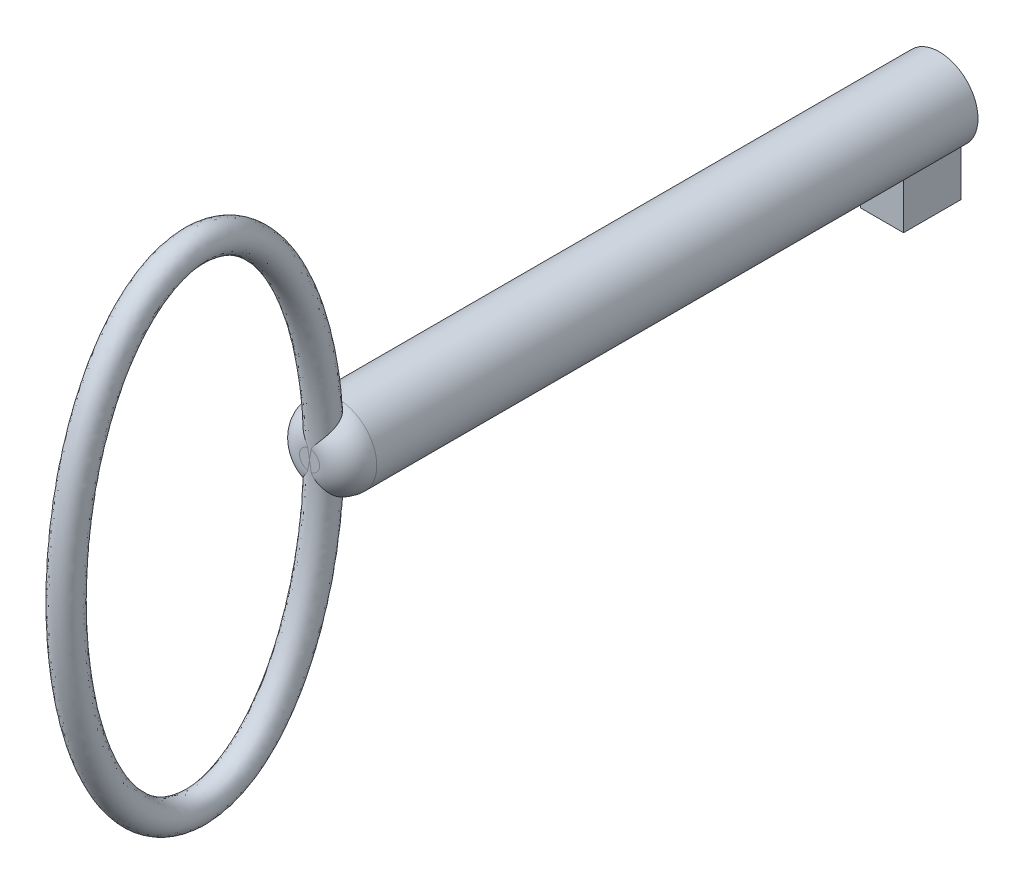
ISO-10303-21;
HEADER;
FILE_DESCRIPTION(('STEP AP214'),'2;1');
FILE_NAME('part.step','',(''),(''),'','','');
FILE_SCHEMA(('AUTOMOTIVE_DESIGN { 1 0 10303 214 1 1 1 1 }'));
ENDSEC;
DATA;
#1=APPLICATION_CONTEXT('core data for automotive mechanical design processes');
#2=APPLICATION_PROTOCOL_DEFINITION('international standard','automotive_design',2000,#1);
#3=PRODUCT_CONTEXT('',#1,'mechanical');
#4=PRODUCT('Part','Part','',(#3));
#5=PRODUCT_RELATED_PRODUCT_CATEGORY('part','',(#4));
#6=PRODUCT_DEFINITION_FORMATION('','',#4);
#7=PRODUCT_DEFINITION_CONTEXT('part definition',#1,'design');
#8=PRODUCT_DEFINITION('design','',#6,#7);
#9=PRODUCT_DEFINITION_SHAPE('','',#8);
#10=(LENGTH_UNIT() NAMED_UNIT(*) SI_UNIT(.MILLI.,.METRE.));
#11=(NAMED_UNIT(*) PLANE_ANGLE_UNIT() SI_UNIT($,.RADIAN.));
#12=(NAMED_UNIT(*) SI_UNIT($,.STERADIAN.) SOLID_ANGLE_UNIT());
#13=UNCERTAINTY_MEASURE_WITH_UNIT(LENGTH_MEASURE(1.E-05),#10,'distance_accuracy_value','');
#14=(GEOMETRIC_REPRESENTATION_CONTEXT(3) GLOBAL_UNCERTAINTY_ASSIGNED_CONTEXT((#13)) GLOBAL_UNIT_ASSIGNED_CONTEXT((#10,
#11,#12)) REPRESENTATION_CONTEXT('',''));
#15=CARTESIAN_POINT('',(0.,0.,0.));
#16=DIRECTION('',(0.,0.,1.));
#17=DIRECTION('',(1.,0.,0.));
#18=AXIS2_PLACEMENT_3D('',#15,#16,#17);
#19=CARTESIAN_POINT('',(0.,0.,34.925));
#20=DIRECTION('',(0.,0.,1.));
#21=DIRECTION('',(1.,0.,0.));
#22=AXIS2_PLACEMENT_3D('',#19,#20,#21);
#23=PLANE('',#22);
#24=CARTESIAN_POINT('',(0.0990187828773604,-0.562292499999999,34.925));
#25=CARTESIAN_POINT('',(0.0834791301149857,-0.473819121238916,34.9250000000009));
#26=CARTESIAN_POINT('',(0.0679068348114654,-0.385351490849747,34.9250000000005));
#27=CARTESIAN_POINT('',(0.0367370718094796,-0.208420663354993,34.9249999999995));
#28=CARTESIAN_POINT('',(0.021139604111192,-0.119957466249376,34.924999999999));
#29=CARTESIAN_POINT('',(0.00369962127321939,-0.0209953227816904,34.9249999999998));
#30=CARTESIAN_POINT('',(0.00184974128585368,-0.0104976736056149,34.9249999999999));
#31=CARTESIAN_POINT('',(0.,-6.10626308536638E-13,34.925));
#32=B_SPLINE_CURVE_WITH_KNOTS('',3,(#24,#25,#26,#27,#28,#29,#30,#31),.UNSPECIFIED.,.F.,.F.,(4,2,
2,4),(0.,0.269483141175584,0.538966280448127,0.570944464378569),.UNSPECIFIED.);
#33=CARTESIAN_POINT('',(0.0963683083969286,-0.547204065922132,34.925));
#34=VERTEX_POINT('',#33);
#35=CARTESIAN_POINT('',(0.,-6.10626308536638E-13,34.925));
#36=VERTEX_POINT('',#35);
#37=EDGE_CURVE('E109',#34,#36,#32,.T.);
#38=ORIENTED_EDGE('',*,*,#37,.F.);
#39=CARTESIAN_POINT('',(0.,0.,34.925));
#40=DIRECTION('',(0.,0.,1.));
#41=DIRECTION('',(1.,0.,0.));
#42=AXIS2_PLACEMENT_3D('',#39,#40,#41);
#43=CIRCLE('',#42,0.555624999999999);
#44=CARTESIAN_POINT('',(0.096368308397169,0.547204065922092,34.925));
#45=VERTEX_POINT('',#44);
#46=EDGE_CURVE('E101',#34,#45,#43,.T.);
#47=ORIENTED_EDGE('',*,*,#46,.T.);
#48=CARTESIAN_POINT('',(0.0990187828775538,0.562292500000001,34.925));
#49=CARTESIAN_POINT('',(0.083479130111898,0.473819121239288,34.9250000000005));
#50=CARTESIAN_POINT('',(0.0679068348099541,0.385351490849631,34.9250000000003));
#51=CARTESIAN_POINT('',(0.0367370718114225,0.20842066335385,34.9249999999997));
#52=CARTESIAN_POINT('',(0.0211396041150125,0.119957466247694,34.9249999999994));
#53=CARTESIAN_POINT('',(0.00369962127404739,0.0209953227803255,34.9249999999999));
#54=CARTESIAN_POINT('',(0.00184974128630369,0.0104976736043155,34.9249999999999));
#55=CARTESIAN_POINT('',(0.,-6.10626308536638E-13,34.925));
#56=B_SPLINE_CURVE_WITH_KNOTS('',3,(#48,#49,#50,#51,#52,#53,#54,#55),.UNSPECIFIED.,.F.,.F.,(4,2,
2,4),(0.,0.269483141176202,0.538966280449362,0.570944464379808),.UNSPECIFIED.);
#57=EDGE_CURVE('E113',#36,#45,#56,.F.);
#58=ORIENTED_EDGE('',*,*,#57,.F.);
#59=EDGE_LOOP('',(#38,#47,#58));
#60=FACE_BOUND('',#59,.T.);
#61=ADVANCED_FACE('F38',(#60),#23,.T.);
#62=CARTESIAN_POINT('',(-1.190625,-4.365625,3.175));
#63=DIRECTION('',(0.,1.,0.));
#64=DIRECTION('',(0.,0.,1.));
#65=AXIS2_PLACEMENT_3D('',#62,#63,#64);
#66=PLANE('',#65);
#67=DIRECTION('',(1.,0.,0.));
#68=VECTOR('',#67,1.);
#69=CARTESIAN_POINT('',(-1.190625,-4.365625,0.));
#70=LINE('',#69,#68);
#71=CARTESIAN_POINT('',(-1.190625,-4.365625,0.));
#72=VERTEX_POINT('',#71);
#73=CARTESIAN_POINT('',(1.190625,-4.365625,0.));
#74=VERTEX_POINT('',#73);
#75=EDGE_CURVE('E165',#72,#74,#70,.T.);
#76=ORIENTED_EDGE('',*,*,#75,.T.);
#77=DIRECTION('',(0.,0.,-1.));
#78=VECTOR('',#77,1.);
#79=CARTESIAN_POINT('',(1.190625,-4.365625,3.175));
#80=LINE('',#79,#78);
#81=CARTESIAN_POINT('',(1.190625,-4.365625,3.175));
#82=VERTEX_POINT('',#81);
#83=EDGE_CURVE('E171',#82,#74,#80,.T.);
#84=ORIENTED_EDGE('',*,*,#83,.F.);
#85=DIRECTION('',(1.,0.,0.));
#86=VECTOR('',#85,1.);
#87=CARTESIAN_POINT('',(-1.190625,-4.365625,3.175));
#88=LINE('',#87,#86);
#89=CARTESIAN_POINT('',(-1.190625,-4.365625,3.175));
#90=VERTEX_POINT('',#89);
#91=EDGE_CURVE('E166',#90,#82,#88,.T.);
#92=ORIENTED_EDGE('',*,*,#91,.F.);
#93=DIRECTION('',(0.,0.,-1.));
#94=VECTOR('',#93,1.);
#95=CARTESIAN_POINT('',(-1.190625,-4.365625,3.175));
#96=LINE('',#95,#94);
#97=EDGE_CURVE('E175',#90,#72,#96,.T.);
#98=ORIENTED_EDGE('',*,*,#97,.T.);
#99=EDGE_LOOP('',(#76,#84,#92,#98));
#100=FACE_BOUND('',#99,.T.);
#101=ADVANCED_FACE('F205',(#100),#66,.F.);
#102=CARTESIAN_POINT('',(1.190625,-4.365625,3.175));
#103=DIRECTION('',(-1.,0.,0.));
#104=DIRECTION('',(0.,0.,1.));
#105=AXIS2_PLACEMENT_3D('',#102,#103,#104);
#106=PLANE('',#105);
#107=DIRECTION('',(0.,1.,0.));
#108=VECTOR('',#107,1.);
#109=CARTESIAN_POINT('',(1.190625,-4.365625,0.));
#110=LINE('',#109,#108);
#111=CARTESIAN_POINT('',(1.190625,-1.78196433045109,0.));
#112=VERTEX_POINT('',#111);
#113=EDGE_CURVE('E199',#74,#112,#110,.T.);
#114=ORIENTED_EDGE('',*,*,#113,.T.);
#115=DIRECTION('',(0.,0.,-1.));
#116=VECTOR('',#115,1.);
#117=CARTESIAN_POINT('',(1.190625,-1.78196433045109,3.175));
#118=LINE('',#117,#116);
#119=CARTESIAN_POINT('',(1.190625,-1.78196433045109,3.175));
#120=VERTEX_POINT('',#119);
#121=EDGE_CURVE('E182',#120,#112,#118,.T.);
#122=ORIENTED_EDGE('',*,*,#121,.F.);
#123=DIRECTION('',(0.,1.,0.));
#124=VECTOR('',#123,1.);
#125=CARTESIAN_POINT('',(1.190625,-4.365625,3.175));
#126=LINE('',#125,#124);
#127=EDGE_CURVE('E176',#82,#120,#126,.T.);
#128=ORIENTED_EDGE('',*,*,#127,.F.);
#129=ORIENTED_EDGE('',*,*,#83,.T.);
#130=EDGE_LOOP('',(#114,#122,#128,#129));
#131=FACE_BOUND('',#130,.T.);
#132=ADVANCED_FACE('F197',(#131),#106,.F.);
#133=CARTESIAN_POINT('',(0.,0.,3.175));
#134=DIRECTION('',(0.,0.,-1.));
#135=DIRECTION('',(-1.,0.,0.));
#136=AXIS2_PLACEMENT_3D('',#133,#134,#135);
#137=CYLINDRICAL_SURFACE('',#136,2.143125);
#138=CARTESIAN_POINT('',(0.,0.,33.3375));
#139=DIRECTION('',(0.,0.,1.));
#140=DIRECTION('',(1.,0.,0.));
#141=AXIS2_PLACEMENT_3D('',#138,#139,#140);
#142=CIRCLE('',#141,2.143125);
#143=CARTESIAN_POINT('',(2.143125,0.,33.3375));
#144=VERTEX_POINT('',#143);
#145=EDGE_CURVE('E100',#144,#144,#142,.F.);
#146=ORIENTED_EDGE('',*,*,#145,.T.);
#147=EDGE_LOOP('',(#146));
#148=FACE_BOUND('',#147,.T.);
#149=CARTESIAN_POINT('',(0.,0.,0.));
#150=DIRECTION('',(0.,0.,1.));
#151=DIRECTION('',(1.,0.,0.));
#152=AXIS2_PLACEMENT_3D('',#149,#150,#151);
#153=CIRCLE('',#152,2.143125);
#154=CARTESIAN_POINT('',(-1.190625,-1.78196433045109,0.));
#155=VERTEX_POINT('',#154);
#156=EDGE_CURVE('E209',#112,#155,#153,.T.);
#157=ORIENTED_EDGE('',*,*,#156,.T.);
#158=DIRECTION('',(0.,0.,-1.));
#159=VECTOR('',#158,1.);
#160=CARTESIAN_POINT('',(-1.190625,-1.78196433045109,3.175));
#161=LINE('',#160,#159);
#162=CARTESIAN_POINT('',(-1.190625,-1.78196433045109,3.175));
#163=VERTEX_POINT('',#162);
#164=EDGE_CURVE('E179',#163,#155,#161,.T.);
#165=ORIENTED_EDGE('',*,*,#164,.F.);
#166=CARTESIAN_POINT('',(0.,0.,3.175));
#167=DIRECTION('',(0.,0.,1.));
#168=DIRECTION('',(1.,0.,0.));
#169=AXIS2_PLACEMENT_3D('',#166,#167,#168);
#170=CIRCLE('',#169,2.143125);
#171=EDGE_CURVE('E161',#163,#120,#170,.T.);
#172=ORIENTED_EDGE('',*,*,#171,.T.);
#173=ORIENTED_EDGE('',*,*,#121,.T.);
#174=EDGE_LOOP('',(#157,#165,#172,#173));
#175=FACE_BOUND('',#174,.T.);
#176=ADVANCED_FACE('F221',(#148,#175),#137,.T.);
#177=CARTESIAN_POINT('',(-1.190625,-1.78196433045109,3.175));
#178=DIRECTION('',(1.,0.,0.));
#179=DIRECTION('',(0.,0.,-1.));
#180=AXIS2_PLACEMENT_3D('',#177,#178,#179);
#181=PLANE('',#180);
#182=DIRECTION('',(0.,-1.,0.));
#183=VECTOR('',#182,1.);
#184=CARTESIAN_POINT('',(-1.190625,-1.78196433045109,0.));
#185=LINE('',#184,#183);
#186=EDGE_CURVE('E213',#155,#72,#185,.T.);
#187=ORIENTED_EDGE('',*,*,#186,.T.);
#188=ORIENTED_EDGE('',*,*,#97,.F.);
#189=DIRECTION('',(0.,-1.,0.));
#190=VECTOR('',#189,1.);
#191=CARTESIAN_POINT('',(-1.190625,-1.78196433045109,3.175));
#192=LINE('',#191,#190);
#193=EDGE_CURVE('E173',#163,#90,#192,.T.);
#194=ORIENTED_EDGE('',*,*,#193,.F.);
#195=ORIENTED_EDGE('',*,*,#164,.T.);
#196=EDGE_LOOP('',(#187,#188,#194,#195));
#197=FACE_BOUND('',#196,.T.);
#198=ADVANCED_FACE('F219',(#197),#181,.F.);
#199=CARTESIAN_POINT('',(0.,0.,3.175));
#200=DIRECTION('',(0.,0.,1.));
#201=DIRECTION('',(1.,0.,0.));
#202=AXIS2_PLACEMENT_3D('',#199,#200,#201);
#203=PLANE('',#202);
#204=ORIENTED_EDGE('',*,*,#171,.F.);
#205=ORIENTED_EDGE('',*,*,#193,.T.);
#206=ORIENTED_EDGE('',*,*,#91,.T.);
#207=ORIENTED_EDGE('',*,*,#127,.T.);
#208=EDGE_LOOP('',(#204,#205,#206,#207));
#209=FACE_BOUND('',#208,.T.);
#210=ADVANCED_FACE('F217',(#209),#203,.T.);
#211=CARTESIAN_POINT('',(0.,0.,0.));
#212=DIRECTION('',(0.,0.,1.));
#213=DIRECTION('',(1.,0.,0.));
#214=AXIS2_PLACEMENT_3D('',#211,#212,#213);
#215=PLANE('',#214);
#216=CARTESIAN_POINT('',(0.,0.,0.));
#217=DIRECTION('',(0.,0.,-1.));
#218=DIRECTION('',(-1.,0.,0.));
#219=AXIS2_PLACEMENT_3D('',#216,#217,#218);
#220=CIRCLE('',#219,0.79375);
#221=CARTESIAN_POINT('',(-0.79375,0.,0.));
#222=VERTEX_POINT('',#221);
#223=EDGE_CURVE('E245',#222,#222,#220,.T.);
#224=ORIENTED_EDGE('',*,*,#223,.F.);
#225=EDGE_LOOP('',(#224));
#226=FACE_BOUND('',#225,.T.);
#227=ORIENTED_EDGE('',*,*,#75,.F.);
#228=ORIENTED_EDGE('',*,*,#186,.F.);
#229=ORIENTED_EDGE('',*,*,#156,.F.);
#230=ORIENTED_EDGE('',*,*,#113,.F.);
#231=EDGE_LOOP('',(#227,#228,#229,#230));
#232=FACE_BOUND('',#231,.T.);
#233=ADVANCED_FACE('F227',(#226,#232),#215,.F.);
#234=CARTESIAN_POINT('',(-0.0990187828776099,0.562292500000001,34.925));
#235=CARTESIAN_POINT('',(-0.0834791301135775,0.473819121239,34.9250000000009));
#236=CARTESIAN_POINT('',(-0.0679068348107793,0.385351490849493,34.9250000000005));
#237=CARTESIAN_POINT('',(-0.0367370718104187,0.20842066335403,34.9249999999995));
#238=CARTESIAN_POINT('',(-0.021139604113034,0.119957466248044,34.924999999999));
#239=CARTESIAN_POINT('',(-0.00369962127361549,0.0209953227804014,34.9249999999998));
#240=CARTESIAN_POINT('',(-0.0018497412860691,0.0104976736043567,34.9249999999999));
#241=CARTESIAN_POINT('',(0.,-6.10626308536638E-13,34.925));
#242=B_SPLINE_CURVE_WITH_KNOTS('',3,(#234,#235,#236,#237,#238,#239,#240,#241),.UNSPECIFIED.,.F.,
.F.,(4,2,2,4),(0.,0.269483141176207,0.538966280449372,0.570944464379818),.UNSPECIFIED.);
#243=CARTESIAN_POINT('',(-0.0963683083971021,0.547204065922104,34.925));
#244=VERTEX_POINT('',#243);
#245=EDGE_CURVE('E104',#244,#36,#242,.T.);
#246=ORIENTED_EDGE('',*,*,#245,.F.);
#247=CARTESIAN_POINT('',(-0.0963683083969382,-0.547204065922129,34.925));
#248=VERTEX_POINT('',#247);
#249=EDGE_CURVE('E96',#244,#248,#43,.T.);
#250=ORIENTED_EDGE('',*,*,#249,.T.);
#251=CARTESIAN_POINT('',(-0.0990187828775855,-0.562292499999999,34.925));
#252=CARTESIAN_POINT('',(-0.083479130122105,-0.473819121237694,34.9250000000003));
#253=CARTESIAN_POINT('',(-0.0679068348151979,-0.385351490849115,34.9250000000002));
#254=CARTESIAN_POINT('',(-0.0367370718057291,-0.208420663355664,34.9249999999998));
#255=CARTESIAN_POINT('',(-0.0211396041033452,-0.119957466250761,34.9249999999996));
#256=CARTESIAN_POINT('',(-0.00369962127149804,-0.0209953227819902,34.9249999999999));
#257=CARTESIAN_POINT('',(-0.00184974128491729,-0.0104976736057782,34.9249999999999));
#258=CARTESIAN_POINT('',(0.,-6.10626308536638E-13,34.925));
#259=B_SPLINE_CURVE_WITH_KNOTS('',3,(#251,#252,#253,#254,#255,#256,#257,#258),.UNSPECIFIED.,.F.,
.F.,(4,2,2,4),(0.,0.269483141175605,0.538966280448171,0.570944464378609),.UNSPECIFIED.);
#260=EDGE_CURVE('E59',#36,#248,#259,.F.);
#261=ORIENTED_EDGE('',*,*,#260,.F.);
#262=EDGE_LOOP('',(#246,#250,#261));
#263=FACE_BOUND('',#262,.T.);
#264=ADVANCED_FACE('F105',(#263),#23,.T.);
#265=CARTESIAN_POINT('',(0.,0.,33.3375));
#266=DIRECTION('',(0.,0.,1.));
#267=DIRECTION('',(1.,0.,0.));
#268=AXIS2_PLACEMENT_3D('',#265,#266,#267);
#269=DEGENERATE_TOROIDAL_SURFACE('',#268,0.555624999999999,1.5875,.T.);
#270=CARTESIAN_POINT('',(-0.0963683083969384,-0.54720406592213,34.925));
#271=CARTESIAN_POINT('',(-0.0984879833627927,-0.559211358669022,34.9250004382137));
#272=CARTESIAN_POINT('',(-0.101694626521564,-0.570929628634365,34.9248595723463));
#273=CARTESIAN_POINT('',(-0.109625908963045,-0.593735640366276,34.9243141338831));
#274=CARTESIAN_POINT('',(-0.114337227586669,-0.604827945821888,34.9239118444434));
#275=CARTESIAN_POINT('',(-0.124638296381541,-0.626447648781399,34.9228661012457));
#276=CARTESIAN_POINT('',(-0.130220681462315,-0.636978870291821,34.9222246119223));
#277=CARTESIAN_POINT('',(-0.141977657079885,-0.657724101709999,34.9207059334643));
#278=CARTESIAN_POINT('',(-0.148153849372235,-0.667937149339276,34.9198280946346));
#279=CARTESIAN_POINT('',(-0.16826309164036,-0.699835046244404,34.9166844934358));
#280=CARTESIAN_POINT('',(-0.182865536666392,-0.721051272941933,34.9139917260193));
#281=CARTESIAN_POINT('',(-0.212775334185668,-0.762787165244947,34.907511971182));
#282=CARTESIAN_POINT('',(-0.228082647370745,-0.783306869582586,34.9037250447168));
#283=CARTESIAN_POINT('',(-0.259008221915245,-0.823878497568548,34.8950320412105));
#284=CARTESIAN_POINT('',(-0.274626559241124,-0.843930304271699,34.8901256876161));
#285=CARTESIAN_POINT('',(-0.306096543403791,-0.883902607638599,34.8791114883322));
#286=CARTESIAN_POINT('',(-0.321948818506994,-0.903818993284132,34.8729905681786));
#287=CARTESIAN_POINT('',(-0.353524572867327,-0.94334402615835,34.8595690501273));
#288=CARTESIAN_POINT('',(-0.369248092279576,-0.962952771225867,34.8522688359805));
#289=CARTESIAN_POINT('',(-0.400421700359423,-1.00190234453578,34.8364788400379));
#290=CARTESIAN_POINT('',(-0.415871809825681,-1.02124319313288,34.8279891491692));
#291=CARTESIAN_POINT('',(-0.453909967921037,-1.06918368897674,34.8053198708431));
#292=CARTESIAN_POINT('',(-0.47625220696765,-1.0976354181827,34.7904017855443));
#293=CARTESIAN_POINT('',(-0.519628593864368,-1.15400847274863,34.7579187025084));
#294=CARTESIAN_POINT('',(-0.540662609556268,-1.18192974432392,34.7403534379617));
#295=CARTESIAN_POINT('',(-0.601091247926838,-1.26472069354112,34.6838545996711));
#296=CARTESIAN_POINT('',(-0.638002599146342,-1.31884909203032,34.6410079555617));
#297=CARTESIAN_POINT('',(-0.697142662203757,-1.41661933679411,34.5530347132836));
#298=CARTESIAN_POINT('',(-0.720744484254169,-1.46061432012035,34.509219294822));
#299=CARTESIAN_POINT('',(-0.758932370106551,-1.54640281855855,34.4157905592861));
#300=CARTESIAN_POINT('',(-0.773519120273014,-1.58819650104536,34.3661776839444));
#301=CARTESIAN_POINT('',(-0.791880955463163,-1.6693052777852,34.2623612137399));
#302=CARTESIAN_POINT('',(-0.795570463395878,-1.70859839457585,34.2081247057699));
#303=CARTESIAN_POINT('',(-0.790238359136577,-1.78358163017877,34.09775272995));
#304=CARTESIAN_POINT('',(-0.781225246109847,-1.81927414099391,34.0416185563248));
#305=CARTESIAN_POINT('',(-0.751765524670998,-1.88135385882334,33.9385779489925));
#306=CARTESIAN_POINT('',(-0.73315554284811,-1.90834067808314,33.8915083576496));
#307=CARTESIAN_POINT('',(-0.685781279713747,-1.95848229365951,33.8005464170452));
#308=CARTESIAN_POINT('',(-0.657029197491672,-1.98164164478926,33.7566503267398));
#309=CARTESIAN_POINT('',(-0.594588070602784,-2.02073885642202,33.6801238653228));
#310=CARTESIAN_POINT('',(-0.562123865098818,-2.03723197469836,33.6467745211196));
#311=CARTESIAN_POINT('',(-0.49089341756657,-2.06674479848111,33.585744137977));
#312=CARTESIAN_POINT('',(-0.452130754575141,-2.07976646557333,33.5580598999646));
#313=CARTESIAN_POINT('',(-0.37311581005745,-2.10117024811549,33.5117976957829));
#314=CARTESIAN_POINT('',(-0.333285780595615,-2.10985723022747,33.4926374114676));
#315=CARTESIAN_POINT('',(-0.250545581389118,-2.12408358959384,33.4609471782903));
#316=CARTESIAN_POINT('',(-0.20763637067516,-2.1296239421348,33.4484151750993));
#317=CARTESIAN_POINT('',(-0.121994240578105,-2.13733203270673,33.4309049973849));
#318=CARTESIAN_POINT('',(-0.0793361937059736,-2.13963708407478,33.4256195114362));
#319=CARTESIAN_POINT('',(0.00633670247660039,-2.14130555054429,33.421798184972));
#320=CARTESIAN_POINT('',(0.0493515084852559,-2.14066931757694,33.423261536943));
#321=CARTESIAN_POINT('',(0.133838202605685,-2.13649223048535,33.4328067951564));
#322=CARTESIAN_POINT('',(0.175323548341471,-2.13299499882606,33.4407892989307));
#323=CARTESIAN_POINT('',(0.256254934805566,-2.12318013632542,33.4629406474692));
#324=CARTESIAN_POINT('',(0.295701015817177,-2.11686256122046,33.4771093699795));
#325=CARTESIAN_POINT('',(0.371738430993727,-2.10141311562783,33.5112121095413));
#326=CARTESIAN_POINT('',(0.408309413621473,-2.09226311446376,33.5311832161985));
#327=CARTESIAN_POINT('',(0.477379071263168,-2.07125764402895,33.576109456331));
#328=CARTESIAN_POINT('',(0.509877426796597,-2.05940196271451,33.6010649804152));
#329=CARTESIAN_POINT('',(0.570948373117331,-2.03273597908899,33.6558545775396));
#330=CARTESIAN_POINT('',(0.59937909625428,-2.01784969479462,33.6858095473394));
#331=CARTESIAN_POINT('',(0.650609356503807,-1.98554416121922,33.7489794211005));
#332=CARTESIAN_POINT('',(0.673407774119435,-1.96812440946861,33.7821949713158));
#333=CARTESIAN_POINT('',(0.71423048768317,-1.92990256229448,33.8527679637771));
#334=CARTESIAN_POINT('',(0.731903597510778,-1.90896333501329,33.8902538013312));
#335=CARTESIAN_POINT('',(0.7605830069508,-1.86479156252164,33.9663927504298));
#336=CARTESIAN_POINT('',(0.771587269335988,-1.84155831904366,34.0050462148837));
#337=CARTESIAN_POINT('',(0.787841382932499,-1.79087709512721,34.0859192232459));
#338=CARTESIAN_POINT('',(0.792474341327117,-1.76323797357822,34.1281422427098));
#339=CARTESIAN_POINT('',(0.794566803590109,-1.70594250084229,34.2113643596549));
#340=CARTESIAN_POINT('',(0.79202329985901,-1.67628530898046,34.2523629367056));
#341=CARTESIAN_POINT('',(0.779735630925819,-1.61145810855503,34.337103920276));
#342=CARTESIAN_POINT('',(0.769130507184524,-1.57606257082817,34.3805479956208));
#343=CARTESIAN_POINT('',(0.740869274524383,-1.50351751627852,34.4634819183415));
#344=CARTESIAN_POINT('',(0.723209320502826,-1.46636705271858,34.5029695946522));
#345=CARTESIAN_POINT('',(0.678856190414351,-1.38475281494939,34.5829440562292));
#346=CARTESIAN_POINT('',(0.651188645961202,-1.34004625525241,34.6226417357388));
#347=CARTESIAN_POINT('',(0.589950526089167,-1.24904266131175,34.6949308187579));
#348=CARTESIAN_POINT('',(0.556379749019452,-1.20274557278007,34.7275219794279));
#349=CARTESIAN_POINT('',(0.478879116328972,-1.10040997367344,34.7903099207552));
#350=CARTESIAN_POINT('',(0.434165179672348,-1.04408757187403,34.8190831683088));
#351=CARTESIAN_POINT('',(0.36520004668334,-0.957883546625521,34.8544558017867));
#352=CARTESIAN_POINT('',(0.34184907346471,-0.928804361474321,34.8649615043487));
#353=CARTESIAN_POINT('',(0.295023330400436,-0.869946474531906,34.8833989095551));
#354=CARTESIAN_POINT('',(0.271548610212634,-0.840168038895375,34.891331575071));
#355=CARTESIAN_POINT('',(0.227961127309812,-0.783263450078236,34.9038822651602));
#356=CARTESIAN_POINT('',(0.207784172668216,-0.756250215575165,34.908784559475));
#357=CARTESIAN_POINT('',(0.178722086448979,-0.714856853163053,34.9147027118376));
#358=CARTESIAN_POINT('',(0.169274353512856,-0.700976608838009,34.916431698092));
#359=CARTESIAN_POINT('',(0.151033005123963,-0.672741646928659,34.9194280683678));
#360=CARTESIAN_POINT('',(0.14223939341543,-0.658386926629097,34.9206954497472));
#361=CARTESIAN_POINT('',(0.125647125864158,-0.628642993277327,34.9227849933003));
#362=CARTESIAN_POINT('',(0.117873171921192,-0.613238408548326,34.9235972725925));
#363=CARTESIAN_POINT('',(0.108042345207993,-0.589242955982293,34.9244283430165));
#364=CARTESIAN_POINT('',(0.105059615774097,-0.581050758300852,34.9246408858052));
#365=CARTESIAN_POINT('',(0.0999761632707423,-0.564352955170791,34.9249273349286));
#366=CARTESIAN_POINT('',(0.0978800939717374,-0.555845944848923,34.9250005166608));
#367=CARTESIAN_POINT('',(0.0963683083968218,-0.547204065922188,34.925));
#368=B_SPLINE_CURVE_WITH_KNOTS('',3,(#270,#271,#272,#273,#274,#275,#276,#277,#278,#279,#280,
#281,#282,#283,#284,#285,#286,#287,#288,#289,#290,#291,#292,#293,#294,#295,#296,#297,#298,#299,
#300,#301,#302,#303,#304,#305,#306,#307,#308,#309,#310,#311,#312,#313,#314,#315,#316,#317,#318,
#319,#320,#321,#322,#323,#324,#325,#326,#327,#328,#329,#330,#331,#332,#333,#334,#335,#336,#337,
#338,#339,#340,#341,#342,#343,#344,#345,#346,#347,#348,#349,#350,#351,#352,#353,#354,#355,#356,
#357,#358,#359,#360,#361,#362,#363,#364,#365,#366,#367),.UNSPECIFIED.,.F.,.F.,(4,2,2,2,2,2,2,2,
2,2,2,2,2,2,2,2,2,2,2,2,2,2,2,2,2,2,2,2,2,2,2,2,2,2,2,2,2,2,2,2,2,2,2,2,2,2,2,2,4),(0.,
0.036391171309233,0.0724687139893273,0.10825627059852,0.144143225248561,0.22175641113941,
0.299365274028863,0.376993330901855,0.455507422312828,0.533996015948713,0.612478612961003,
0.729746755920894,0.847026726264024,1.08063927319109,1.27913071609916,1.47760704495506,
1.67763793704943,1.87753505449,2.04859986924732,2.21945962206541,2.36679407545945,
2.51404509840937,2.64849850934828,2.7829102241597,2.91142438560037,3.03992317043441,
3.16649842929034,3.29307118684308,3.42047151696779,3.54788183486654,3.67900215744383,
3.81014852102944,3.94885878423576,4.08761139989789,4.23902832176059,4.39050871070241,
4.56093841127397,4.73146112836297,4.92834310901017,5.12523181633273,5.35666742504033,
5.47283432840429,5.58895770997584,5.69108492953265,5.74170384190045,5.79232304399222,
5.84400264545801,5.87011952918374,5.89637183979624),.UNSPECIFIED.);
#369=EDGE_CURVE('E12',#248,#34,#368,.T.);
#370=ORIENTED_EDGE('',*,*,#369,.F.);
#371=ORIENTED_EDGE('',*,*,#249,.F.);
#372=CARTESIAN_POINT('',(0.096368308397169,0.547204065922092,34.925));
#373=CARTESIAN_POINT('',(0.0984879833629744,0.559211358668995,34.9250004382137));
#374=CARTESIAN_POINT('',(0.101694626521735,0.570929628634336,34.9248595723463));
#375=CARTESIAN_POINT('',(0.109625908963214,0.593735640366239,34.9243141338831));
#376=CARTESIAN_POINT('',(0.114337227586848,0.604827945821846,34.9239118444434));
#377=CARTESIAN_POINT('',(0.124638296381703,0.626447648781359,34.9228661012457));
#378=CARTESIAN_POINT('',(0.130220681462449,0.636978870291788,34.9222246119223));
#379=CARTESIAN_POINT('',(0.141977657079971,0.657724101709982,34.9207059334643));
#380=CARTESIAN_POINT('',(0.148153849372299,0.667937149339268,34.9198280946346));
#381=CARTESIAN_POINT('',(0.168263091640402,0.699835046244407,34.9166844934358));
#382=CARTESIAN_POINT('',(0.18286553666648,0.721051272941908,34.9139917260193));
#383=CARTESIAN_POINT('',(0.212775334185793,0.762787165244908,34.907511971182));
#384=CARTESIAN_POINT('',(0.22808264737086,0.783306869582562,34.9037250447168));
#385=CARTESIAN_POINT('',(0.259008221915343,0.823878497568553,34.8950320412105));
#386=CARTESIAN_POINT('',(0.274626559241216,0.843930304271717,34.8901256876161));
#387=CARTESIAN_POINT('',(0.306096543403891,0.883902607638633,34.8791114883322));
#388=CARTESIAN_POINT('',(0.321948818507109,0.903818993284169,34.8729905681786));
#389=CARTESIAN_POINT('',(0.353524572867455,0.943344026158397,34.8595690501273));
#390=CARTESIAN_POINT('',(0.369248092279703,0.962952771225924,34.8522688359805));
#391=CARTESIAN_POINT('',(0.400421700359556,1.00190234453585,34.8364788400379));
#392=CARTESIAN_POINT('',(0.415871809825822,1.02124319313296,34.8279891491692));
#393=CARTESIAN_POINT('',(0.453909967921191,1.06918368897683,34.805319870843));
#394=CARTESIAN_POINT('',(0.476252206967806,1.09763541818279,34.7904017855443));
#395=CARTESIAN_POINT('',(0.519628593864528,1.15400847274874,34.7579187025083));
#396=CARTESIAN_POINT('',(0.54066260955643,1.18192974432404,34.7403534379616));
#397=CARTESIAN_POINT('',(0.601091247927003,1.26472069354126,34.683854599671));
#398=CARTESIAN_POINT('',(0.638002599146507,1.31884909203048,34.6410079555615));
#399=CARTESIAN_POINT('',(0.697142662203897,1.41661933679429,34.5530347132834));
#400=CARTESIAN_POINT('',(0.720744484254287,1.46061432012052,34.5092192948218));
#401=CARTESIAN_POINT('',(0.758932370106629,1.54640281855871,34.4157905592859));
#402=CARTESIAN_POINT('',(0.773519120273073,1.5881965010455,34.3661776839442));
#403=CARTESIAN_POINT('',(0.791880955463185,1.66930527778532,34.2623612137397));
#404=CARTESIAN_POINT('',(0.795570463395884,1.70859839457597,34.2081247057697));
#405=CARTESIAN_POINT('',(0.790238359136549,1.78358163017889,34.0977527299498));
#406=CARTESIAN_POINT('',(0.7812252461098,1.81927414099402,34.0416185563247));
#407=CARTESIAN_POINT('',(0.751765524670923,1.88135385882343,33.9385779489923));
#408=CARTESIAN_POINT('',(0.733155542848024,1.90834067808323,33.8915083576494));
#409=CARTESIAN_POINT('',(0.685781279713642,1.95848229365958,33.8005464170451));
#410=CARTESIAN_POINT('',(0.657029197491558,1.98164164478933,33.7566503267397));
#411=CARTESIAN_POINT('',(0.594588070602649,2.02073885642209,33.6801238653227));
#412=CARTESIAN_POINT('',(0.56212386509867,2.03723197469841,33.6467745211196));
#413=CARTESIAN_POINT('',(0.490893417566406,2.06674479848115,33.585744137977));
#414=CARTESIAN_POINT('',(0.452130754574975,2.07976646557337,33.5580598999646));
#415=CARTESIAN_POINT('',(0.373115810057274,2.10117024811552,33.5117976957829));
#416=CARTESIAN_POINT('',(0.333285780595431,2.1098572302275,33.4926374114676));
#417=CARTESIAN_POINT('',(0.250545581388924,2.12408358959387,33.4609471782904));
#418=CARTESIAN_POINT('',(0.207636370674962,2.12962394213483,33.4484151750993));
#419=CARTESIAN_POINT('',(0.121994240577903,2.13733203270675,33.430904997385));
#420=CARTESIAN_POINT('',(0.0793361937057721,2.13963708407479,33.4256195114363));
#421=CARTESIAN_POINT('',(-0.00633670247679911,2.14130555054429,33.421798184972));
#422=CARTESIAN_POINT('',(-0.0493515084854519,2.14066931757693,33.4232615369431));
#423=CARTESIAN_POINT('',(-0.133838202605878,2.13649223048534,33.4328067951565));
#424=CARTESIAN_POINT('',(-0.175323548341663,2.13299499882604,33.4407892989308));
#425=CARTESIAN_POINT('',(-0.256254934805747,2.12318013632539,33.4629406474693));
#426=CARTESIAN_POINT('',(-0.295701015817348,2.11686256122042,33.4771093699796));
#427=CARTESIAN_POINT('',(-0.371738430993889,2.10141311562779,33.5112121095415));
#428=CARTESIAN_POINT('',(-0.408309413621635,2.09226311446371,33.5311832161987));
#429=CARTESIAN_POINT('',(-0.477379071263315,2.0712576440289,33.5761094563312));
#430=CARTESIAN_POINT('',(-0.509877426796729,2.05940196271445,33.6010649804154));
#431=CARTESIAN_POINT('',(-0.570948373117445,2.03273597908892,33.6558545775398));
#432=CARTESIAN_POINT('',(-0.59937909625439,2.01784969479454,33.6858095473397));
#433=CARTESIAN_POINT('',(-0.650609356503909,1.98554416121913,33.7489794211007));
#434=CARTESIAN_POINT('',(-0.673407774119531,1.96812440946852,33.7821949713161));
#435=CARTESIAN_POINT('',(-0.714230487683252,1.92990256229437,33.8527679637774));
#436=CARTESIAN_POINT('',(-0.731903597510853,1.90896333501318,33.8902538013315));
#437=CARTESIAN_POINT('',(-0.760583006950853,1.8647915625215,33.96639275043));
#438=CARTESIAN_POINT('',(-0.771587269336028,1.84155831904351,34.005046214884));
#439=CARTESIAN_POINT('',(-0.787841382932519,1.79087709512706,34.0859192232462));
#440=CARTESIAN_POINT('',(-0.792474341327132,1.76323797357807,34.12814224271));
#441=CARTESIAN_POINT('',(-0.794566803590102,1.70594250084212,34.2113643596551));
#442=CARTESIAN_POINT('',(-0.792023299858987,1.67628530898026,34.2523629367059));
#443=CARTESIAN_POINT('',(-0.779735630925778,1.61145810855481,34.3371039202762));
#444=CARTESIAN_POINT('',(-0.769130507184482,1.57606257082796,34.380547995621));
#445=CARTESIAN_POINT('',(-0.740869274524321,1.5035175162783,34.4634819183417));
#446=CARTESIAN_POINT('',(-0.723209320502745,1.46636705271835,34.5029695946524));
#447=CARTESIAN_POINT('',(-0.678856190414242,1.38475281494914,34.5829440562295));
#448=CARTESIAN_POINT('',(-0.651188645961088,1.34004625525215,34.622641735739));
#449=CARTESIAN_POINT('',(-0.589950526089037,1.24904266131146,34.6949308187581));
#450=CARTESIAN_POINT('',(-0.556379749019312,1.20274557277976,34.727521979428));
#451=CARTESIAN_POINT('',(-0.4788791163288,1.1004099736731,34.7903099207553));
#452=CARTESIAN_POINT('',(-0.434165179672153,1.0440875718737,34.8190831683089));
#453=CARTESIAN_POINT('',(-0.365200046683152,0.957883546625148,34.8544558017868));
#454=CARTESIAN_POINT('',(-0.341849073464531,0.928804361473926,34.8649615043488));
#455=CARTESIAN_POINT('',(-0.295023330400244,0.869946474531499,34.8833989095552));
#456=CARTESIAN_POINT('',(-0.27154861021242,0.840168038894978,34.8913315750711));
#457=CARTESIAN_POINT('',(-0.227961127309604,0.783263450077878,34.9038822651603));
#458=CARTESIAN_POINT('',(-0.207784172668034,0.75625021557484,34.9087845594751));
#459=CARTESIAN_POINT('',(-0.178722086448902,0.714856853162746,34.9147027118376));
#460=CARTESIAN_POINT('',(-0.169274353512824,0.700976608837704,34.916431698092));
#461=CARTESIAN_POINT('',(-0.151033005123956,0.6727416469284,34.9194280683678));
#462=CARTESIAN_POINT('',(-0.142239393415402,0.658386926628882,34.9206954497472));
#463=CARTESIAN_POINT('',(-0.125647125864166,0.628642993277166,34.9227849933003));
#464=CARTESIAN_POINT('',(-0.117873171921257,0.613238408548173,34.9235972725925));
#465=CARTESIAN_POINT('',(-0.10804234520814,0.589242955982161,34.9244283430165));
#466=CARTESIAN_POINT('',(-0.10505961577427,0.581050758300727,34.9246408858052));
#467=CARTESIAN_POINT('',(-0.0999761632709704,0.564352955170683,34.9249273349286));
#468=CARTESIAN_POINT('',(-0.0978800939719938,0.555845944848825,34.9250005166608));
#469=CARTESIAN_POINT('',(-0.0963683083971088,0.5472040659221,34.925));
#470=B_SPLINE_CURVE_WITH_KNOTS('',3,(#372,#373,#374,#375,#376,#377,#378,#379,#380,#381,#382,
#383,#384,#385,#386,#387,#388,#389,#390,#391,#392,#393,#394,#395,#396,#397,#398,#399,#400,#401,
#402,#403,#404,#405,#406,#407,#408,#409,#410,#411,#412,#413,#414,#415,#416,#417,#418,#419,#420,
#421,#422,#423,#424,#425,#426,#427,#428,#429,#430,#431,#432,#433,#434,#435,#436,#437,#438,#439,
#440,#441,#442,#443,#444,#445,#446,#447,#448,#449,#450,#451,#452,#453,#454,#455,#456,#457,#458,
#459,#460,#461,#462,#463,#464,#465,#466,#467,#468,#469),.UNSPECIFIED.,.F.,.F.,(4,2,2,2,2,2,2,2,
2,2,2,2,2,2,2,2,2,2,2,2,2,2,2,2,2,2,2,2,2,2,2,2,2,2,2,2,2,2,2,2,2,2,2,2,2,2,2,2,4),(0.,
0.0363911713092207,0.0724687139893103,0.108256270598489,0.144143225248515,0.221756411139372,
0.299365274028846,0.376993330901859,0.455507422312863,0.533996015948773,0.612478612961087,
0.72974675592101,0.847026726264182,1.08063927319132,1.27913071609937,1.47760704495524,
1.67763793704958,1.87753505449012,2.04859986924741,2.21945962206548,2.36679407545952,
2.51404509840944,2.64849850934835,2.78291022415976,2.91142438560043,3.03992317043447,
3.1664984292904,3.29307118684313,3.42047151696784,3.54788183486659,3.67900215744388,
3.8101485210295,3.94885878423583,4.08761139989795,4.23902832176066,4.39050871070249,
4.56093841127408,4.73146112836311,4.92834310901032,5.12523181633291,5.35666742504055,
5.47283432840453,5.5889577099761,5.69108492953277,5.74170384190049,5.79232304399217,
5.84400264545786,5.87011952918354,5.89637183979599),.UNSPECIFIED.);
#471=EDGE_CURVE('E52',#45,#244,#470,.T.);
#472=ORIENTED_EDGE('',*,*,#471,.F.);
#473=ORIENTED_EDGE('',*,*,#46,.F.);
#474=EDGE_LOOP('',(#370,#371,#472,#473));
#475=FACE_BOUND('',#474,.T.);
#476=ORIENTED_EDGE('',*,*,#145,.F.);
#477=EDGE_LOOP('',(#476));
#478=FACE_BOUND('',#477,.T.);
#479=ADVANCED_FACE('F40',(#475,#478),#269,.T.);
#480=CARTESIAN_POINT('',(0.,0.,34.925));
#481=CARTESIAN_POINT('',(0.,0.87158086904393,34.925));
#482=CARTESIAN_POINT('',(0.,2.53726944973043,35.0101814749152));
#483=CARTESIAN_POINT('',(0.,4.86854671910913,35.3706237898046));
#484=CARTESIAN_POINT('',(0.,6.87096360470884,35.897935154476));
#485=CARTESIAN_POINT('',(0.,8.515269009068,36.5294656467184));
#486=CARTESIAN_POINT('',(0.,9.81288193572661,37.2111987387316));
#487=CARTESIAN_POINT('',(0.,10.7641018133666,37.8769631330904));
#488=CARTESIAN_POINT('',(0.,11.438768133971,38.4927761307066));
#489=CARTESIAN_POINT('',(0.,11.9068942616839,39.0420365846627));
#490=CARTESIAN_POINT('',(0.,12.2416440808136,39.558426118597));
#491=CARTESIAN_POINT('',(0.,12.4687846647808,40.0387946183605));
#492=CARTESIAN_POINT('',(0.,12.6103668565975,40.4824840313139));
#493=CARTESIAN_POINT('',(0.,12.684704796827,40.8904776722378));
#494=CARTESIAN_POINT('',(0.,12.7072880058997,41.2750000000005));
#495=CARTESIAN_POINT('',(0.,12.684704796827,41.6595223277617));
#496=CARTESIAN_POINT('',(0.,12.6103668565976,42.0675159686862));
#497=CARTESIAN_POINT('',(0.,12.4687846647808,42.5112053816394));
#498=CARTESIAN_POINT('',(0.,12.2416440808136,42.991573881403));
#499=CARTESIAN_POINT('',(0.,11.9068942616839,43.5079634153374));
#500=CARTESIAN_POINT('',(0.,11.4387681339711,44.0572238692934));
#501=CARTESIAN_POINT('',(0.,10.7641018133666,44.6730368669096));
#502=CARTESIAN_POINT('',(0.,9.81288193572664,45.3388012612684));
#503=CARTESIAN_POINT('',(0.,8.51526900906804,46.0205343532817));
#504=CARTESIAN_POINT('',(0.,6.87096360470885,46.6520648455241));
#505=CARTESIAN_POINT('',(0.,4.86854671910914,47.1793762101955));
#506=CARTESIAN_POINT('',(0.,2.53726944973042,47.5398185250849));
#507=CARTESIAN_POINT('',(0.,0.,47.6695716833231));
#508=CARTESIAN_POINT('',(0.,-2.53726944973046,47.5398185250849));
#509=CARTESIAN_POINT('',(0.,-4.86854671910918,47.1793762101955));
#510=CARTESIAN_POINT('',(0.,-6.87096360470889,46.6520648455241));
#511=CARTESIAN_POINT('',(0.,-8.51526900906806,46.0205343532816));
#512=CARTESIAN_POINT('',(0.,-9.81288193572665,45.3388012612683));
#513=CARTESIAN_POINT('',(0.,-10.7641018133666,44.6730368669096));
#514=CARTESIAN_POINT('',(0.,-11.4387681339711,44.0572238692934));
#515=CARTESIAN_POINT('',(0.,-11.9068942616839,43.5079634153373));
#516=CARTESIAN_POINT('',(0.,-12.2416440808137,42.9915738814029));
#517=CARTESIAN_POINT('',(0.,-12.4687846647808,42.5112053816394));
#518=CARTESIAN_POINT('',(0.,-12.6103668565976,42.067515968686));
#519=CARTESIAN_POINT('',(0.,-12.684704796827,41.6595223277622));
#520=CARTESIAN_POINT('',(0.,-12.7072880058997,41.2749999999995));
#521=CARTESIAN_POINT('',(0.,-12.684704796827,40.8904776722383));
#522=CARTESIAN_POINT('',(0.,-12.6103668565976,40.4824840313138));
#523=CARTESIAN_POINT('',(0.,-12.4687846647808,40.0387946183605));
#524=CARTESIAN_POINT('',(0.,-12.2416440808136,39.558426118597));
#525=CARTESIAN_POINT('',(0.,-11.9068942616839,39.0420365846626));
#526=CARTESIAN_POINT('',(0.,-11.438768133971,38.4927761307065));
#527=CARTESIAN_POINT('',(0.,-10.7641018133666,37.8769631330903));
#528=CARTESIAN_POINT('',(0.,-9.81288193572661,37.2111987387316));
#529=CARTESIAN_POINT('',(0.,-8.51526900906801,36.5294656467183));
#530=CARTESIAN_POINT('',(0.,-6.87096360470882,35.8979351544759));
#531=CARTESIAN_POINT('',(0.,-4.8685467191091,35.3706237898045));
#532=CARTESIAN_POINT('',(0.,-2.5372694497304,35.0101814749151));
#533=CARTESIAN_POINT('',(0.,-0.871580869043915,34.925));
#534=CARTESIAN_POINT('',(0.,0.,34.925));
#535=CARTESIAN_POINT('',(1.5875,0.,34.925));
#536=CARTESIAN_POINT('',(1.5875,0.87158086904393,34.925));
#537=CARTESIAN_POINT('',(1.5875,2.53726944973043,35.0101814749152));
#538=CARTESIAN_POINT('',(1.5875,4.86854671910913,35.3706237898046));
#539=CARTESIAN_POINT('',(1.5875,6.87096360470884,35.897935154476));
#540=CARTESIAN_POINT('',(1.5875,8.51526900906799,36.5294656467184));
#541=CARTESIAN_POINT('',(1.5875,9.81288193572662,37.2111987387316));
#542=CARTESIAN_POINT('',(1.5875,10.7641018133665,37.8769631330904));
#543=CARTESIAN_POINT('',(1.5875,11.438768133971,38.4927761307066));
#544=CARTESIAN_POINT('',(1.5875,11.9068942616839,39.0420365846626));
#545=CARTESIAN_POINT('',(1.5875,12.2416440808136,39.558426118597));
#546=CARTESIAN_POINT('',(1.5875,12.4687846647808,40.0387946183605));
#547=CARTESIAN_POINT('',(1.5875,12.6103668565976,40.4824840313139));
#548=CARTESIAN_POINT('',(1.5875,12.684704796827,40.8904776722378));
#549=CARTESIAN_POINT('',(1.5875,12.7072880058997,41.2750000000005));
#550=CARTESIAN_POINT('',(1.5875,12.684704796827,41.6595223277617));
#551=CARTESIAN_POINT('',(1.5875,12.6103668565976,42.0675159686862));
#552=CARTESIAN_POINT('',(1.5875,12.4687846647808,42.5112053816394));
#553=CARTESIAN_POINT('',(1.5875,12.2416440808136,42.991573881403));
#554=CARTESIAN_POINT('',(1.5875,11.9068942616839,43.5079634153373));
#555=CARTESIAN_POINT('',(1.5875,11.4387681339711,44.0572238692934));
#556=CARTESIAN_POINT('',(1.5875,10.7641018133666,44.6730368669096));
#557=CARTESIAN_POINT('',(1.5875,9.81288193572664,45.3388012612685));
#558=CARTESIAN_POINT('',(1.5875,8.51526900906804,46.0205343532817));
#559=CARTESIAN_POINT('',(1.5875,6.87096360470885,46.6520648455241));
#560=CARTESIAN_POINT('',(1.5875,4.86854671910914,47.1793762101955));
#561=CARTESIAN_POINT('',(1.5875,2.53726944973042,47.5398185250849));
#562=CARTESIAN_POINT('',(1.5875,0.,47.669571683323));
#563=CARTESIAN_POINT('',(1.5875,-2.53726944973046,47.5398185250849));
#564=CARTESIAN_POINT('',(1.5875,-4.86854671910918,47.1793762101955));
#565=CARTESIAN_POINT('',(1.5875,-6.87096360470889,46.6520648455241));
#566=CARTESIAN_POINT('',(1.5875,-8.51526900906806,46.0205343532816));
#567=CARTESIAN_POINT('',(1.5875,-9.81288193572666,45.3388012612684));
#568=CARTESIAN_POINT('',(1.5875,-10.7641018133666,44.6730368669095));
#569=CARTESIAN_POINT('',(1.5875,-11.4387681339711,44.0572238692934));
#570=CARTESIAN_POINT('',(1.5875,-11.9068942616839,43.5079634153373));
#571=CARTESIAN_POINT('',(1.5875,-12.2416440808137,42.9915738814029));
#572=CARTESIAN_POINT('',(1.5875,-12.4687846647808,42.5112053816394));
#573=CARTESIAN_POINT('',(1.5875,-12.6103668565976,42.0675159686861));
#574=CARTESIAN_POINT('',(1.5875,-12.684704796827,41.6595223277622));
#575=CARTESIAN_POINT('',(1.5875,-12.7072880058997,41.2749999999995));
#576=CARTESIAN_POINT('',(1.5875,-12.684704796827,40.8904776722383));
#577=CARTESIAN_POINT('',(1.5875,-12.6103668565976,40.4824840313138));
#578=CARTESIAN_POINT('',(1.5875,-12.4687846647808,40.0387946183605));
#579=CARTESIAN_POINT('',(1.5875,-12.2416440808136,39.558426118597));
#580=CARTESIAN_POINT('',(1.5875,-11.9068942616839,39.0420365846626));
#581=CARTESIAN_POINT('',(1.5875,-11.438768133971,38.4927761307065));
#582=CARTESIAN_POINT('',(1.5875,-10.7641018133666,37.8769631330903));
#583=CARTESIAN_POINT('',(1.5875,-9.81288193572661,37.2111987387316));
#584=CARTESIAN_POINT('',(1.5875,-8.51526900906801,36.5294656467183));
#585=CARTESIAN_POINT('',(1.5875,-6.87096360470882,35.8979351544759));
#586=CARTESIAN_POINT('',(1.5875,-4.8685467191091,35.3706237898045));
#587=CARTESIAN_POINT('',(1.5875,-2.5372694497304,35.0101814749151));
#588=CARTESIAN_POINT('',(1.5875,-0.871580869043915,34.925));
#589=CARTESIAN_POINT('',(1.5875,0.,34.925));
#590=CARTESIAN_POINT('',(1.5875,0.,33.3375));
#591=CARTESIAN_POINT('',(1.5875,0.92604368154,33.3375));
#592=CARTESIAN_POINT('',(1.5875,2.69581679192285,33.4278764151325));
#593=CARTESIAN_POINT('',(1.5875,5.18662753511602,33.8124347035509));
#594=CARTESIAN_POINT('',(1.5875,7.35087725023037,34.3814592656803));
#595=CARTESIAN_POINT('',(1.5875,9.16153603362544,35.0755630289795));
#596=CARTESIAN_POINT('',(1.5875,10.6300691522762,35.8452995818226));
#597=CARTESIAN_POINT('',(1.5875,11.7477062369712,36.6251997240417));
#598=CARTESIAN_POINT('',(1.5875,12.5761300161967,37.3793502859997));
#599=CARTESIAN_POINT('',(1.5875,13.1777268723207,38.0831099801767));
#600=CARTESIAN_POINT('',(1.5875,13.6285382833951,38.7762665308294));
#601=CARTESIAN_POINT('',(1.5875,13.9478660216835,39.449332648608));
#602=CARTESIAN_POINT('',(1.5875,14.1538639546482,40.0927965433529));
#603=CARTESIAN_POINT('',(1.5875,14.2644994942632,40.6982229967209));
#604=CARTESIAN_POINT('',(1.5875,14.2984595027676,41.2749999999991));
#605=CARTESIAN_POINT('',(1.5875,14.2644994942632,41.8517770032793));
#606=CARTESIAN_POINT('',(1.5875,14.1538639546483,42.457203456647));
#607=CARTESIAN_POINT('',(1.5875,13.9478660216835,43.100667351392));
#608=CARTESIAN_POINT('',(1.5875,13.6285382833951,43.7737334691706));
#609=CARTESIAN_POINT('',(1.5875,13.1777268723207,44.4668900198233));
#610=CARTESIAN_POINT('',(1.5875,12.5761300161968,45.1706497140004));
#611=CARTESIAN_POINT('',(1.5875,11.7477062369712,45.9248002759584));
#612=CARTESIAN_POINT('',(1.5875,10.6300691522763,46.7047004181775));
#613=CARTESIAN_POINT('',(1.5875,9.16153603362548,47.4744369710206));
#614=CARTESIAN_POINT('',(1.5875,7.35087725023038,48.1685407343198));
#615=CARTESIAN_POINT('',(1.5875,5.18662753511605,48.7375652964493));
#616=CARTESIAN_POINT('',(1.5875,2.69581679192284,49.1221235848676));
#617=CARTESIAN_POINT('',(1.5875,0.,49.2597899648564));
#618=CARTESIAN_POINT('',(1.5875,-2.69581679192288,49.1221235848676));
#619=CARTESIAN_POINT('',(1.5875,-5.18662753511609,48.7375652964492));
#620=CARTESIAN_POINT('',(1.5875,-7.35087725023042,48.1685407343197));
#621=CARTESIAN_POINT('',(1.5875,-9.16153603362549,47.4744369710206));
#622=CARTESIAN_POINT('',(1.5875,-10.6300691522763,46.7047004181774));
#623=CARTESIAN_POINT('',(1.5875,-11.7477062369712,45.9248002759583));
#624=CARTESIAN_POINT('',(1.5875,-12.5761300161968,45.1706497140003));
#625=CARTESIAN_POINT('',(1.5875,-13.1777268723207,44.4668900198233));
#626=CARTESIAN_POINT('',(1.5875,-13.6285382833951,43.7737334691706));
#627=CARTESIAN_POINT('',(1.5875,-13.9478660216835,43.1006673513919));
#628=CARTESIAN_POINT('',(1.5875,-14.1538639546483,42.4572034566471));
#629=CARTESIAN_POINT('',(1.5875,-14.2644994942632,41.8517770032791));
#630=CARTESIAN_POINT('',(1.5875,-14.2984595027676,41.2750000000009));
#631=CARTESIAN_POINT('',(1.5875,-14.2644994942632,40.6982229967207));
#632=CARTESIAN_POINT('',(1.5875,-14.1538639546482,40.092796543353));
#633=CARTESIAN_POINT('',(1.5875,-13.9478660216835,39.4493326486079));
#634=CARTESIAN_POINT('',(1.5875,-13.6285382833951,38.7762665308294));
#635=CARTESIAN_POINT('',(1.5875,-13.1777268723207,38.0831099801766));
#636=CARTESIAN_POINT('',(1.5875,-12.5761300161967,37.3793502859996));
#637=CARTESIAN_POINT('',(1.5875,-11.7477062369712,36.6251997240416));
#638=CARTESIAN_POINT('',(1.5875,-10.6300691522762,35.8452995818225));
#639=CARTESIAN_POINT('',(1.5875,-9.16153603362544,35.0755630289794));
#640=CARTESIAN_POINT('',(1.5875,-7.35087725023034,34.3814592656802));
#641=CARTESIAN_POINT('',(1.5875,-5.18662753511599,33.8124347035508));
#642=CARTESIAN_POINT('',(1.5875,-2.69581679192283,33.4278764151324));
#643=CARTESIAN_POINT('',(1.5875,-0.926043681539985,33.3375));
#644=CARTESIAN_POINT('',(1.5875,0.,33.3375));
#645=CARTESIAN_POINT('',(0.,0.,33.3375));
#646=CARTESIAN_POINT('',(0.,0.926043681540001,33.3375));
#647=CARTESIAN_POINT('',(0.,2.69581679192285,33.4278764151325));
#648=CARTESIAN_POINT('',(0.,5.18662753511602,33.8124347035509));
#649=CARTESIAN_POINT('',(0.,7.35087725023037,34.3814592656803));
#650=CARTESIAN_POINT('',(0.,9.16153603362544,35.0755630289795));
#651=CARTESIAN_POINT('',(0.,10.6300691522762,35.8452995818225));
#652=CARTESIAN_POINT('',(0.,11.7477062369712,36.6251997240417));
#653=CARTESIAN_POINT('',(0.,12.5761300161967,37.3793502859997));
#654=CARTESIAN_POINT('',(0.,13.1777268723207,38.0831099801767));
#655=CARTESIAN_POINT('',(0.,13.6285382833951,38.7762665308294));
#656=CARTESIAN_POINT('',(0.,13.9478660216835,39.449332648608));
#657=CARTESIAN_POINT('',(0.,14.1538639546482,40.0927965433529));
#658=CARTESIAN_POINT('',(0.,14.2644994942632,40.6982229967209));
#659=CARTESIAN_POINT('',(0.,14.2984595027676,41.2749999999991));
#660=CARTESIAN_POINT('',(0.,14.2644994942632,41.8517770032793));
#661=CARTESIAN_POINT('',(0.,14.1538639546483,42.457203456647));
#662=CARTESIAN_POINT('',(0.,13.9478660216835,43.100667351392));
#663=CARTESIAN_POINT('',(0.,13.6285382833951,43.7737334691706));
#664=CARTESIAN_POINT('',(0.,13.1777268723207,44.4668900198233));
#665=CARTESIAN_POINT('',(0.,12.5761300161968,45.1706497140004));
#666=CARTESIAN_POINT('',(0.,11.7477062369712,45.9248002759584));
#667=CARTESIAN_POINT('',(0.,10.6300691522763,46.7047004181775));
#668=CARTESIAN_POINT('',(0.,9.16153603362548,47.4744369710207));
#669=CARTESIAN_POINT('',(0.,7.35087725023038,48.1685407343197));
#670=CARTESIAN_POINT('',(0.,5.18662753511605,48.7375652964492));
#671=CARTESIAN_POINT('',(0.,2.69581679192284,49.1221235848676));
#672=CARTESIAN_POINT('',(0.,0.,49.2597899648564));
#673=CARTESIAN_POINT('',(0.,-2.69581679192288,49.1221235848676));
#674=CARTESIAN_POINT('',(0.,-5.18662753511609,48.7375652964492));
#675=CARTESIAN_POINT('',(0.,-7.35087725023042,48.1685407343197));
#676=CARTESIAN_POINT('',(0.,-9.1615360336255,47.4744369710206));
#677=CARTESIAN_POINT('',(0.,-10.6300691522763,46.7047004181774));
#678=CARTESIAN_POINT('',(0.,-11.7477062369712,45.9248002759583));
#679=CARTESIAN_POINT('',(0.,-12.5761300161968,45.1706497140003));
#680=CARTESIAN_POINT('',(0.,-13.1777268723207,44.4668900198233));
#681=CARTESIAN_POINT('',(0.,-13.6285382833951,43.7737334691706));
#682=CARTESIAN_POINT('',(0.,-13.9478660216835,43.100667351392));
#683=CARTESIAN_POINT('',(0.,-14.1538639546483,42.4572034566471));
#684=CARTESIAN_POINT('',(0.,-14.2644994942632,41.8517770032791));
#685=CARTESIAN_POINT('',(0.,-14.2984595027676,41.2750000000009));
#686=CARTESIAN_POINT('',(0.,-14.2644994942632,40.6982229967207));
#687=CARTESIAN_POINT('',(0.,-14.1538639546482,40.092796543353));
#688=CARTESIAN_POINT('',(0.,-13.9478660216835,39.4493326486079));
#689=CARTESIAN_POINT('',(0.,-13.6285382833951,38.7762665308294));
#690=CARTESIAN_POINT('',(0.,-13.1777268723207,38.0831099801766));
#691=CARTESIAN_POINT('',(0.,-12.5761300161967,37.3793502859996));
#692=CARTESIAN_POINT('',(0.,-11.7477062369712,36.6251997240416));
#693=CARTESIAN_POINT('',(0.,-10.6300691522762,35.8452995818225));
#694=CARTESIAN_POINT('',(0.,-9.16153603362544,35.0755630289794));
#695=CARTESIAN_POINT('',(0.,-7.35087725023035,34.3814592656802));
#696=CARTESIAN_POINT('',(0.,-5.18662753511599,33.8124347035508));
#697=CARTESIAN_POINT('',(0.,-2.69581679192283,33.4278764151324));
#698=CARTESIAN_POINT('',(0.,-0.926043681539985,33.3375));
#699=CARTESIAN_POINT('',(0.,0.,33.3375));
#700=CARTESIAN_POINT('',(-1.5875,0.,33.3375));
#701=CARTESIAN_POINT('',(-1.5875,0.92604368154,33.3375));
#702=CARTESIAN_POINT('',(-1.5875,2.69581679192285,33.4278764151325));
#703=CARTESIAN_POINT('',(-1.5875,5.18662753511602,33.8124347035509));
#704=CARTESIAN_POINT('',(-1.5875,7.35087725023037,34.3814592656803));
#705=CARTESIAN_POINT('',(-1.5875,9.16153603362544,35.0755630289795));
#706=CARTESIAN_POINT('',(-1.5875,10.6300691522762,35.8452995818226));
#707=CARTESIAN_POINT('',(-1.5875,11.7477062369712,36.6251997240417));
#708=CARTESIAN_POINT('',(-1.5875,12.5761300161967,37.3793502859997));
#709=CARTESIAN_POINT('',(-1.5875,13.1777268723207,38.0831099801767));
#710=CARTESIAN_POINT('',(-1.5875,13.6285382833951,38.7762665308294));
#711=CARTESIAN_POINT('',(-1.5875,13.9478660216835,39.449332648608));
#712=CARTESIAN_POINT('',(-1.5875,14.1538639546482,40.0927965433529));
#713=CARTESIAN_POINT('',(-1.5875,14.2644994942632,40.6982229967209));
#714=CARTESIAN_POINT('',(-1.5875,14.2984595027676,41.2749999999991));
#715=CARTESIAN_POINT('',(-1.5875,14.2644994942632,41.8517770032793));
#716=CARTESIAN_POINT('',(-1.5875,14.1538639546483,42.457203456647));
#717=CARTESIAN_POINT('',(-1.5875,13.9478660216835,43.100667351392));
#718=CARTESIAN_POINT('',(-1.5875,13.6285382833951,43.7737334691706));
#719=CARTESIAN_POINT('',(-1.5875,13.1777268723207,44.4668900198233));
#720=CARTESIAN_POINT('',(-1.5875,12.5761300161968,45.1706497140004));
#721=CARTESIAN_POINT('',(-1.5875,11.7477062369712,45.9248002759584));
#722=CARTESIAN_POINT('',(-1.5875,10.6300691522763,46.7047004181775));
#723=CARTESIAN_POINT('',(-1.5875,9.16153603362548,47.4744369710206));
#724=CARTESIAN_POINT('',(-1.5875,7.35087725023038,48.1685407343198));
#725=CARTESIAN_POINT('',(-1.5875,5.18662753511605,48.7375652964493));
#726=CARTESIAN_POINT('',(-1.5875,2.69581679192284,49.1221235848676));
#727=CARTESIAN_POINT('',(-1.5875,0.,49.2597899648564));
#728=CARTESIAN_POINT('',(-1.5875,-2.69581679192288,49.1221235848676));
#729=CARTESIAN_POINT('',(-1.5875,-5.18662753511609,48.7375652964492));
#730=CARTESIAN_POINT('',(-1.5875,-7.35087725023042,48.1685407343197));
#731=CARTESIAN_POINT('',(-1.5875,-9.16153603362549,47.4744369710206));
#732=CARTESIAN_POINT('',(-1.5875,-10.6300691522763,46.7047004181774));
#733=CARTESIAN_POINT('',(-1.5875,-11.7477062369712,45.9248002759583));
#734=CARTESIAN_POINT('',(-1.5875,-12.5761300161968,45.1706497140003));
#735=CARTESIAN_POINT('',(-1.5875,-13.1777268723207,44.4668900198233));
#736=CARTESIAN_POINT('',(-1.5875,-13.6285382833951,43.7737334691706));
#737=CARTESIAN_POINT('',(-1.5875,-13.9478660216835,43.1006673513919));
#738=CARTESIAN_POINT('',(-1.5875,-14.1538639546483,42.4572034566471));
#739=CARTESIAN_POINT('',(-1.5875,-14.2644994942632,41.8517770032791));
#740=CARTESIAN_POINT('',(-1.5875,-14.2984595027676,41.2750000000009));
#741=CARTESIAN_POINT('',(-1.5875,-14.2644994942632,40.6982229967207));
#742=CARTESIAN_POINT('',(-1.5875,-14.1538639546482,40.092796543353));
#743=CARTESIAN_POINT('',(-1.5875,-13.9478660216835,39.4493326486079));
#744=CARTESIAN_POINT('',(-1.5875,-13.6285382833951,38.7762665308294));
#745=CARTESIAN_POINT('',(-1.5875,-13.1777268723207,38.0831099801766));
#746=CARTESIAN_POINT('',(-1.5875,-12.5761300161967,37.3793502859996));
#747=CARTESIAN_POINT('',(-1.5875,-11.7477062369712,36.6251997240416));
#748=CARTESIAN_POINT('',(-1.5875,-10.6300691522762,35.8452995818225));
#749=CARTESIAN_POINT('',(-1.5875,-9.16153603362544,35.0755630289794));
#750=CARTESIAN_POINT('',(-1.5875,-7.35087725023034,34.3814592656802));
#751=CARTESIAN_POINT('',(-1.5875,-5.18662753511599,33.8124347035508));
#752=CARTESIAN_POINT('',(-1.5875,-2.69581679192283,33.4278764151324));
#753=CARTESIAN_POINT('',(-1.5875,-0.926043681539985,33.3375));
#754=CARTESIAN_POINT('',(-1.5875,0.,33.3375));
#755=CARTESIAN_POINT('',(-1.5875,0.,34.925));
#756=CARTESIAN_POINT('',(-1.5875,0.87158086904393,34.925));
#757=CARTESIAN_POINT('',(-1.5875,2.53726944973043,35.0101814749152));
#758=CARTESIAN_POINT('',(-1.5875,4.86854671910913,35.3706237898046));
#759=CARTESIAN_POINT('',(-1.5875,6.87096360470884,35.897935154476));
#760=CARTESIAN_POINT('',(-1.5875,8.51526900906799,36.5294656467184));
#761=CARTESIAN_POINT('',(-1.5875,9.81288193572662,37.2111987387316));
#762=CARTESIAN_POINT('',(-1.5875,10.7641018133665,37.8769631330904));
#763=CARTESIAN_POINT('',(-1.5875,11.438768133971,38.4927761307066));
#764=CARTESIAN_POINT('',(-1.5875,11.9068942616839,39.0420365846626));
#765=CARTESIAN_POINT('',(-1.5875,12.2416440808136,39.558426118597));
#766=CARTESIAN_POINT('',(-1.5875,12.4687846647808,40.0387946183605));
#767=CARTESIAN_POINT('',(-1.5875,12.6103668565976,40.4824840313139));
#768=CARTESIAN_POINT('',(-1.5875,12.684704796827,40.8904776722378));
#769=CARTESIAN_POINT('',(-1.5875,12.7072880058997,41.2750000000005));
#770=CARTESIAN_POINT('',(-1.5875,12.684704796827,41.6595223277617));
#771=CARTESIAN_POINT('',(-1.5875,12.6103668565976,42.0675159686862));
#772=CARTESIAN_POINT('',(-1.5875,12.4687846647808,42.5112053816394));
#773=CARTESIAN_POINT('',(-1.5875,12.2416440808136,42.991573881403));
#774=CARTESIAN_POINT('',(-1.5875,11.9068942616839,43.5079634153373));
#775=CARTESIAN_POINT('',(-1.5875,11.4387681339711,44.0572238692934));
#776=CARTESIAN_POINT('',(-1.5875,10.7641018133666,44.6730368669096));
#777=CARTESIAN_POINT('',(-1.5875,9.81288193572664,45.3388012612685));
#778=CARTESIAN_POINT('',(-1.5875,8.51526900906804,46.0205343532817));
#779=CARTESIAN_POINT('',(-1.5875,6.87096360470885,46.6520648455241));
#780=CARTESIAN_POINT('',(-1.5875,4.86854671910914,47.1793762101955));
#781=CARTESIAN_POINT('',(-1.5875,2.53726944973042,47.5398185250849));
#782=CARTESIAN_POINT('',(-1.5875,0.,47.669571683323));
#783=CARTESIAN_POINT('',(-1.5875,-2.53726944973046,47.5398185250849));
#784=CARTESIAN_POINT('',(-1.5875,-4.86854671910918,47.1793762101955));
#785=CARTESIAN_POINT('',(-1.5875,-6.87096360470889,46.6520648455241));
#786=CARTESIAN_POINT('',(-1.5875,-8.51526900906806,46.0205343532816));
#787=CARTESIAN_POINT('',(-1.5875,-9.81288193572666,45.3388012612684));
#788=CARTESIAN_POINT('',(-1.5875,-10.7641018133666,44.6730368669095));
#789=CARTESIAN_POINT('',(-1.5875,-11.4387681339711,44.0572238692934));
#790=CARTESIAN_POINT('',(-1.5875,-11.9068942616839,43.5079634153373));
#791=CARTESIAN_POINT('',(-1.5875,-12.2416440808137,42.9915738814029));
#792=CARTESIAN_POINT('',(-1.5875,-12.4687846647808,42.5112053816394));
#793=CARTESIAN_POINT('',(-1.5875,-12.6103668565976,42.0675159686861));
#794=CARTESIAN_POINT('',(-1.5875,-12.684704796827,41.6595223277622));
#795=CARTESIAN_POINT('',(-1.5875,-12.7072880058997,41.2749999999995));
#796=CARTESIAN_POINT('',(-1.5875,-12.684704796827,40.8904776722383));
#797=CARTESIAN_POINT('',(-1.5875,-12.6103668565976,40.4824840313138));
#798=CARTESIAN_POINT('',(-1.5875,-12.4687846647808,40.0387946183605));
#799=CARTESIAN_POINT('',(-1.5875,-12.2416440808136,39.558426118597));
#800=CARTESIAN_POINT('',(-1.5875,-11.9068942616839,39.0420365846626));
#801=CARTESIAN_POINT('',(-1.5875,-11.438768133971,38.4927761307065));
#802=CARTESIAN_POINT('',(-1.5875,-10.7641018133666,37.8769631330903));
#803=CARTESIAN_POINT('',(-1.5875,-9.81288193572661,37.2111987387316));
#804=CARTESIAN_POINT('',(-1.5875,-8.51526900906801,36.5294656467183));
#805=CARTESIAN_POINT('',(-1.5875,-6.87096360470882,35.8979351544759));
#806=CARTESIAN_POINT('',(-1.5875,-4.8685467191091,35.3706237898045));
#807=CARTESIAN_POINT('',(-1.5875,-2.5372694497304,35.0101814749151));
#808=CARTESIAN_POINT('',(-1.5875,-0.871580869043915,34.925));
#809=CARTESIAN_POINT('',(-1.5875,0.,34.925));
#810=CARTESIAN_POINT('',(0.,0.,34.925));
#811=CARTESIAN_POINT('',(0.,0.87158086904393,34.925));
#812=CARTESIAN_POINT('',(0.,2.53726944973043,35.0101814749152));
#813=CARTESIAN_POINT('',(0.,4.86854671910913,35.3706237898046));
#814=CARTESIAN_POINT('',(0.,6.87096360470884,35.897935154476));
#815=CARTESIAN_POINT('',(0.,8.515269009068,36.5294656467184));
#816=CARTESIAN_POINT('',(0.,9.81288193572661,37.2111987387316));
#817=CARTESIAN_POINT('',(0.,10.7641018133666,37.8769631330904));
#818=CARTESIAN_POINT('',(0.,11.438768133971,38.4927761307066));
#819=CARTESIAN_POINT('',(0.,11.9068942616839,39.0420365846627));
#820=CARTESIAN_POINT('',(0.,12.2416440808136,39.558426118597));
#821=CARTESIAN_POINT('',(0.,12.4687846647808,40.0387946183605));
#822=CARTESIAN_POINT('',(0.,12.6103668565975,40.4824840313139));
#823=CARTESIAN_POINT('',(0.,12.684704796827,40.8904776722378));
#824=CARTESIAN_POINT('',(0.,12.7072880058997,41.2750000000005));
#825=CARTESIAN_POINT('',(0.,12.684704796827,41.6595223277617));
#826=CARTESIAN_POINT('',(0.,12.6103668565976,42.0675159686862));
#827=CARTESIAN_POINT('',(0.,12.4687846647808,42.5112053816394));
#828=CARTESIAN_POINT('',(0.,12.2416440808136,42.991573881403));
#829=CARTESIAN_POINT('',(0.,11.9068942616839,43.5079634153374));
#830=CARTESIAN_POINT('',(0.,11.4387681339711,44.0572238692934));
#831=CARTESIAN_POINT('',(0.,10.7641018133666,44.6730368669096));
#832=CARTESIAN_POINT('',(0.,9.81288193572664,45.3388012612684));
#833=CARTESIAN_POINT('',(0.,8.51526900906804,46.0205343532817));
#834=CARTESIAN_POINT('',(0.,6.87096360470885,46.6520648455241));
#835=CARTESIAN_POINT('',(0.,4.86854671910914,47.1793762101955));
#836=CARTESIAN_POINT('',(0.,2.53726944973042,47.5398185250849));
#837=CARTESIAN_POINT('',(0.,0.,47.6695716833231));
#838=CARTESIAN_POINT('',(0.,-2.53726944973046,47.5398185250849));
#839=CARTESIAN_POINT('',(0.,-4.86854671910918,47.1793762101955));
#840=CARTESIAN_POINT('',(0.,-6.87096360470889,46.6520648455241));
#841=CARTESIAN_POINT('',(0.,-8.51526900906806,46.0205343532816));
#842=CARTESIAN_POINT('',(0.,-9.81288193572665,45.3388012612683));
#843=CARTESIAN_POINT('',(0.,-10.7641018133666,44.6730368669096));
#844=CARTESIAN_POINT('',(0.,-11.4387681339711,44.0572238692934));
#845=CARTESIAN_POINT('',(0.,-11.9068942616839,43.5079634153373));
#846=CARTESIAN_POINT('',(0.,-12.2416440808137,42.9915738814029));
#847=CARTESIAN_POINT('',(0.,-12.4687846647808,42.5112053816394));
#848=CARTESIAN_POINT('',(0.,-12.6103668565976,42.067515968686));
#849=CARTESIAN_POINT('',(0.,-12.684704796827,41.6595223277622));
#850=CARTESIAN_POINT('',(0.,-12.7072880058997,41.2749999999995));
#851=CARTESIAN_POINT('',(0.,-12.684704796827,40.8904776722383));
#852=CARTESIAN_POINT('',(0.,-12.6103668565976,40.4824840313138));
#853=CARTESIAN_POINT('',(0.,-12.4687846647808,40.0387946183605));
#854=CARTESIAN_POINT('',(0.,-12.2416440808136,39.558426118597));
#855=CARTESIAN_POINT('',(0.,-11.9068942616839,39.0420365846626));
#856=CARTESIAN_POINT('',(0.,-11.438768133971,38.4927761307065));
#857=CARTESIAN_POINT('',(0.,-10.7641018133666,37.8769631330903));
#858=CARTESIAN_POINT('',(0.,-9.81288193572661,37.2111987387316));
#859=CARTESIAN_POINT('',(0.,-8.51526900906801,36.5294656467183));
#860=CARTESIAN_POINT('',(0.,-6.87096360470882,35.8979351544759));
#861=CARTESIAN_POINT('',(0.,-4.8685467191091,35.3706237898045));
#862=CARTESIAN_POINT('',(0.,-2.5372694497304,35.0101814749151));
#863=CARTESIAN_POINT('',(0.,-0.871580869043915,34.925));
#864=CARTESIAN_POINT('',(0.,0.,34.925));
#865=(BOUNDED_SURFACE() B_SPLINE_SURFACE(3,3,((#480,#481,#482,#483,#484,#485,#486,#487,#488,
#489,#490,#491,#492,#493,#494,#495,#496,#497,#498,#499,#500,#501,#502,#503,#504,#505,#506,#507,
#508,#509,#510,#511,#512,#513,#514,#515,#516,#517,#518,#519,#520,#521,#522,#523,#524,#525,#526,
#527,#528,#529,#530,#531,#532,#533,#534),(#535,#536,#537,#538,#539,#540,#541,#542,#543,#544,
#545,#546,#547,#548,#549,#550,#551,#552,#553,#554,#555,#556,#557,#558,#559,#560,#561,#562,#563,
#564,#565,#566,#567,#568,#569,#570,#571,#572,#573,#574,#575,#576,#577,#578,#579,#580,#581,#582,
#583,#584,#585,#586,#587,#588,#589),(#590,#591,#592,#593,#594,#595,#596,#597,#598,#599,#600,
#601,#602,#603,#604,#605,#606,#607,#608,#609,#610,#611,#612,#613,#614,#615,#616,#617,#618,#619,
#620,#621,#622,#623,#624,#625,#626,#627,#628,#629,#630,#631,#632,#633,#634,#635,#636,#637,#638,
#639,#640,#641,#642,#643,#644),(#645,#646,#647,#648,#649,#650,#651,#652,#653,#654,#655,#656,
#657,#658,#659,#660,#661,#662,#663,#664,#665,#666,#667,#668,#669,#670,#671,#672,#673,#674,#675,
#676,#677,#678,#679,#680,#681,#682,#683,#684,#685,#686,#687,#688,#689,#690,#691,#692,#693,#694,
#695,#696,#697,#698,#699),(#700,#701,#702,#703,#704,#705,#706,#707,#708,#709,#710,#711,#712,
#713,#714,#715,#716,#717,#718,#719,#720,#721,#722,#723,#724,#725,#726,#727,#728,#729,#730,#731,
#732,#733,#734,#735,#736,#737,#738,#739,#740,#741,#742,#743,#744,#745,#746,#747,#748,#749,#750,
#751,#752,#753,#754),(#755,#756,#757,#758,#759,#760,#761,#762,#763,#764,#765,#766,#767,#768,
#769,#770,#771,#772,#773,#774,#775,#776,#777,#778,#779,#780,#781,#782,#783,#784,#785,#786,#787,
#788,#789,#790,#791,#792,#793,#794,#795,#796,#797,#798,#799,#800,#801,#802,#803,#804,#805,#806,
#807,#808,#809),(#810,#811,#812,#813,#814,#815,#816,#817,#818,#819,#820,#821,#822,#823,#824,
#825,#826,#827,#828,#829,#830,#831,#832,#833,#834,#835,#836,#837,#838,#839,#840,#841,#842,#843,
#844,#845,#846,#847,#848,#849,#850,#851,#852,#853,#854,#855,#856,#857,#858,#859,#860,#861,#862,
#863,#864)),.UNSPECIFIED.,.T.,.T.,.F.) B_SPLINE_SURFACE_WITH_KNOTS((4,3,4),(4,1,1,1,1,1,1,1,1,1,
1,1,1,1,1,1,1,1,1,1,1,1,1,1,1,1,1,1,1,1,1,1,1,1,1,1,1,1,1,1,1,1,1,1,1,1,1,1,1,1,1,1,4),(0.,0.5,
1.),(0.,0.0408075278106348,0.0779877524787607,0.110577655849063,0.138357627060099,
0.161641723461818,0.181036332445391,0.195100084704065,0.207247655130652,0.217851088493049,
0.227215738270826,0.235580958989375,0.24312947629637,0.249999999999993,0.256870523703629,
0.264419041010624,0.272784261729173,0.282148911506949,0.292752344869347,0.304899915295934,
0.318963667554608,0.338358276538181,0.3616423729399,0.389422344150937,0.422012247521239,
0.459192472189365,0.5,0.540807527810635,0.577987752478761,0.610577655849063,0.6383576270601,
0.661641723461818,0.681036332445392,0.695100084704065,0.707247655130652,0.71785108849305,
0.727215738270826,0.735580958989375,0.74312947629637,0.749999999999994,0.75687052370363,
0.764419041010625,0.772784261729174,0.782148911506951,0.792752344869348,0.804899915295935,
0.818963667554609,0.838358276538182,0.861642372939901,0.889422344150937,0.92201224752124,
0.959192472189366,1.),
.UNSPECIFIED.) GEOMETRIC_REPRESENTATION_ITEM() RATIONAL_B_SPLINE_SURFACE(((1.,1.,1.,1.,1.,1.,1.,
1.,1.,1.,1.,1.,1.,1.,1.,1.,1.,1.,1.,1.,1.,1.,1.,1.,1.,1.,1.,1.,1.,1.,1.,1.,1.,1.,1.,1.,1.,1.,1.,
1.,1.,1.,1.,1.,1.,1.,1.,1.,1.,1.,1.,1.,1.,1.,1.),(0.333333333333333,0.333333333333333,
0.333333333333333,0.333333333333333,0.333333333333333,0.333333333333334,0.333333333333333,
0.333333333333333,0.333333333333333,0.333333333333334,0.333333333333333,0.333333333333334,
0.333333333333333,0.333333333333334,0.333333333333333,0.333333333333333,0.333333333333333,
0.333333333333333,0.333333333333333,0.333333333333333,0.333333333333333,0.333333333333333,
0.333333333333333,0.333333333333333,0.333333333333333,0.333333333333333,0.333333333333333,
0.333333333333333,0.333333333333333,0.333333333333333,0.333333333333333,0.333333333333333,
0.333333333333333,0.333333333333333,0.333333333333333,0.333333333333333,0.333333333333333,
0.333333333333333,0.333333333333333,0.333333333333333,0.333333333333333,0.333333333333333,
0.333333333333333,0.333333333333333,0.333333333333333,0.333333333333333,0.333333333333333,
0.333333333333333,0.333333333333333,0.333333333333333,0.333333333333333,0.333333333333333,
0.333333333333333,0.333333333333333,0.333333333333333),(0.333333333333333,0.333333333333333,
0.333333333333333,0.333333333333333,0.333333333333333,0.333333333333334,0.333333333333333,
0.333333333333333,0.333333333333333,0.333333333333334,0.333333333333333,0.333333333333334,
0.333333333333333,0.333333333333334,0.333333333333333,0.333333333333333,0.333333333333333,
0.333333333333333,0.333333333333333,0.333333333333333,0.333333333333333,0.333333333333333,
0.333333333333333,0.333333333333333,0.333333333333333,0.333333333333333,0.333333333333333,
0.333333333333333,0.333333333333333,0.333333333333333,0.333333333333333,0.333333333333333,
0.333333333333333,0.333333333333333,0.333333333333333,0.333333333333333,0.333333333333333,
0.333333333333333,0.333333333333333,0.333333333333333,0.333333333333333,0.333333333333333,
0.333333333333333,0.333333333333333,0.333333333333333,0.333333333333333,0.333333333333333,
0.333333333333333,0.333333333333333,0.333333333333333,0.333333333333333,0.333333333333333,
0.333333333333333,0.333333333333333,0.333333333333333),(1.,1.,1.,1.,1.,1.,1.,1.,1.,1.,1.,1.,1.,
1.,1.,1.,1.,1.,1.,1.,1.,1.,1.,1.,1.,1.,1.,1.,1.,1.,1.,1.,1.,1.,1.,1.,1.,1.,1.,1.,1.,1.,1.,1.,1.,
1.,1.,1.,1.,1.,1.,1.,1.,1.,1.),(0.333333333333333,0.333333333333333,0.333333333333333,
0.333333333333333,0.333333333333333,0.333333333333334,0.333333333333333,0.333333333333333,
0.333333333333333,0.333333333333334,0.333333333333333,0.333333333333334,0.333333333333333,
0.333333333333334,0.333333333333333,0.333333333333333,0.333333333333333,0.333333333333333,
0.333333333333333,0.333333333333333,0.333333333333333,0.333333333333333,0.333333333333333,
0.333333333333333,0.333333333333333,0.333333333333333,0.333333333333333,0.333333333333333,
0.333333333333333,0.333333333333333,0.333333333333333,0.333333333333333,0.333333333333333,
0.333333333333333,0.333333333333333,0.333333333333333,0.333333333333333,0.333333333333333,
0.333333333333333,0.333333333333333,0.333333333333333,0.333333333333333,0.333333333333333,
0.333333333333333,0.333333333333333,0.333333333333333,0.333333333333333,0.333333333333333,
0.333333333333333,0.333333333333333,0.333333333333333,0.333333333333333,0.333333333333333,
0.333333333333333,0.333333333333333),(0.333333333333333,0.333333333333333,0.333333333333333,
0.333333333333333,0.333333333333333,0.333333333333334,0.333333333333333,0.333333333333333,
0.333333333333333,0.333333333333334,0.333333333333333,0.333333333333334,0.333333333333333,
0.333333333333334,0.333333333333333,0.333333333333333,0.333333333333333,0.333333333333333,
0.333333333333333,0.333333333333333,0.333333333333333,0.333333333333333,0.333333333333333,
0.333333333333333,0.333333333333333,0.333333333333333,0.333333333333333,0.333333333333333,
0.333333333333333,0.333333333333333,0.333333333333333,0.333333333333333,0.333333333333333,
0.333333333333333,0.333333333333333,0.333333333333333,0.333333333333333,0.333333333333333,
0.333333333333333,0.333333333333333,0.333333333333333,0.333333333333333,0.333333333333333,
0.333333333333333,0.333333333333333,0.333333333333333,0.333333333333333,0.333333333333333,
0.333333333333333,0.333333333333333,0.333333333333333,0.333333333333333,0.333333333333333,
0.333333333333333,0.333333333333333),(1.,1.,1.,1.,1.,1.,1.,1.,1.,1.,1.,1.,1.,1.,1.,1.,1.,1.,1.,
1.,1.,1.,1.,1.,1.,1.,1.,1.,1.,1.,1.,1.,1.,1.,1.,1.,1.,1.,1.,1.,1.,1.,1.,1.,1.,1.,1.,1.,1.,1.,1.,
1.,1.,1.,1.))) REPRESENTATION_ITEM('') SURFACE());
#866=ORIENTED_EDGE('',*,*,#471,.T.);
#867=ORIENTED_EDGE('',*,*,#245,.T.);
#868=ORIENTED_EDGE('',*,*,#57,.T.);
#869=EDGE_LOOP('',(#866,#867,#868));
#870=FACE_BOUND('',#869,.T.);
#871=ORIENTED_EDGE('',*,*,#260,.T.);
#872=ORIENTED_EDGE('',*,*,#369,.T.);
#873=ORIENTED_EDGE('',*,*,#37,.T.);
#874=EDGE_LOOP('',(#871,#872,#873));
#875=FACE_BOUND('',#874,.T.);
#876=ADVANCED_FACE('F111',(#870,#875),#865,.T.);
#877=CARTESIAN_POINT('',(0.,0.,6.35));
#878=DIRECTION('',(0.,0.,-1.));
#879=DIRECTION('',(-1.,0.,0.));
#880=AXIS2_PLACEMENT_3D('',#877,#878,#879);
#881=CYLINDRICAL_SURFACE('',#880,0.79375);
#882=CARTESIAN_POINT('',(0.,0.,6.35));
#883=DIRECTION('',(0.,0.,-1.));
#884=DIRECTION('',(-1.,0.,0.));
#885=AXIS2_PLACEMENT_3D('',#882,#883,#884);
#886=CIRCLE('',#885,0.79375);
#887=CARTESIAN_POINT('',(-0.79375,0.,6.35));
#888=VERTEX_POINT('',#887);
#889=EDGE_CURVE('E247',#888,#888,#886,.T.);
#890=ORIENTED_EDGE('',*,*,#889,.F.);
#891=EDGE_LOOP('',(#890));
#892=FACE_BOUND('',#891,.T.);
#893=ORIENTED_EDGE('',*,*,#223,.T.);
#894=EDGE_LOOP('',(#893));
#895=FACE_BOUND('',#894,.T.);
#896=ADVANCED_FACE('F126',(#892,#895),#881,.F.);
#897=CARTESIAN_POINT('',(0.,0.,6.35));
#898=DIRECTION('',(0.,0.,-1.));
#899=DIRECTION('',(-1.,0.,0.));
#900=AXIS2_PLACEMENT_3D('',#897,#898,#899);
#901=PLANE('',#900);
#902=ORIENTED_EDGE('',*,*,#889,.T.);
#903=EDGE_LOOP('',(#902));
#904=FACE_BOUND('',#903,.T.);
#905=ADVANCED_FACE('F252',(#904),#901,.T.);
#906=CLOSED_SHELL('',(#61,#101,#132,#176,#198,#210,#233,#264,#479,#876,#896,#905));
#907=MANIFOLD_SOLID_BREP('B2',#906);
#908=ADVANCED_BREP_SHAPE_REPRESENTATION('',(#18,#907),#14);
#909=SHAPE_DEFINITION_REPRESENTATION(#9,#908);
ENDSEC;
END-ISO-10303-21;
